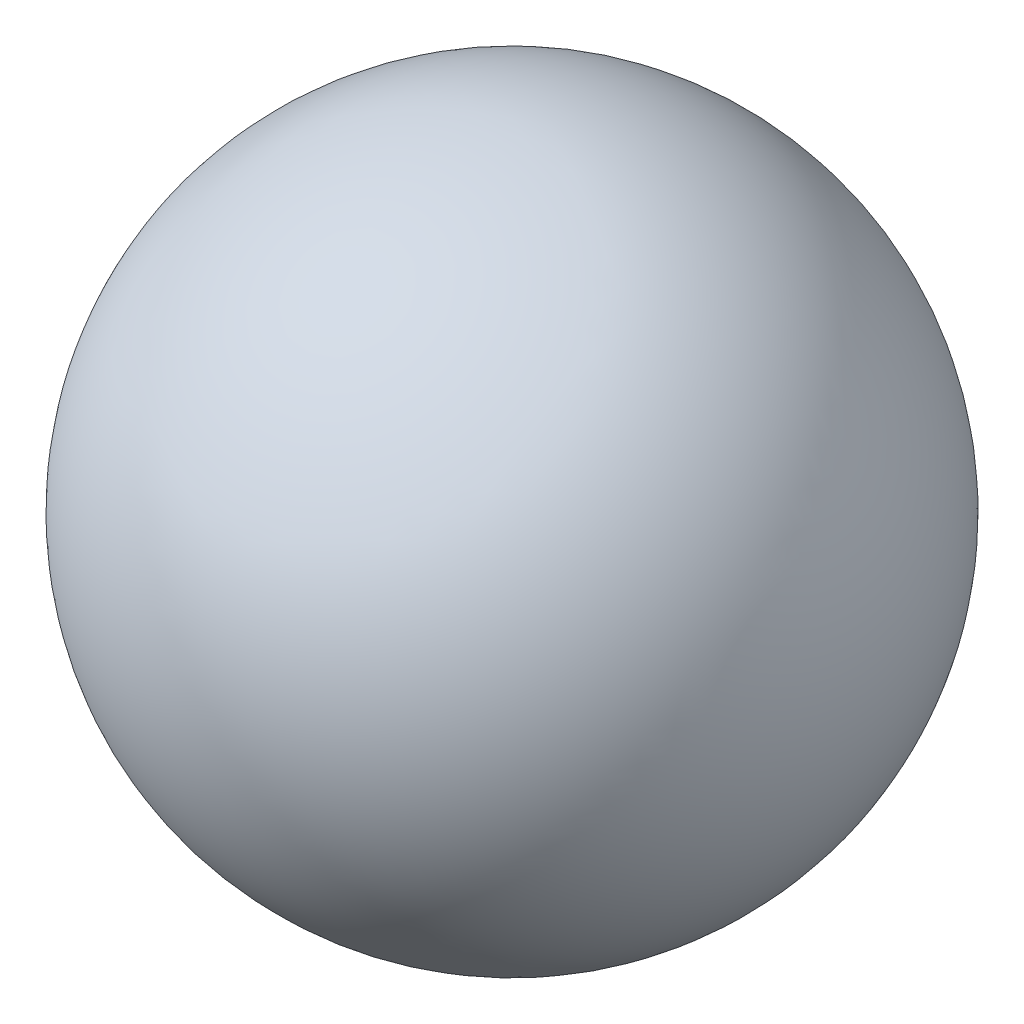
from build123d import *


with BuildPart() as part:
    # Esquisse1 → Base-R_volution (revolve)
    with BuildSketch(Plane(origin=(0, 0, 0), x_dir=(1, 0, 0), z_dir=(0, 1, 0))):
        with BuildLine():
            Line((-6.25, 0), (6.25, 0))
            ThreePointArc((6.25, 0), (0, 6.25), (-6.25, 0))
        make_face()
    revolve(axis=Axis((-6.25, 0, 0), (1, 0, 0)))


solid = part.part
